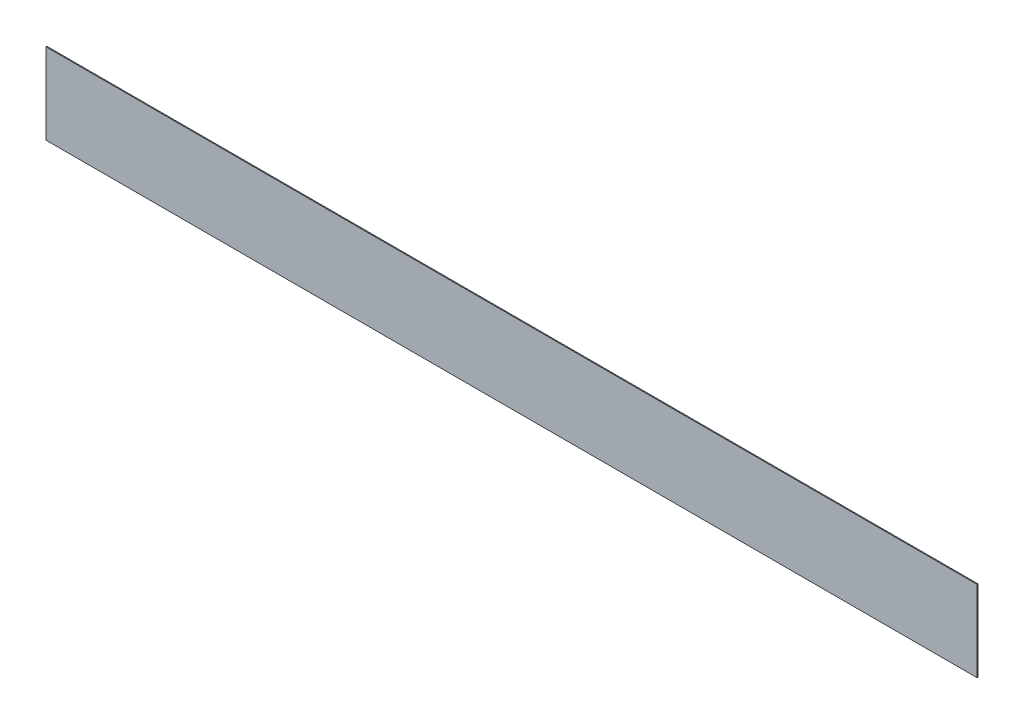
ISO-10303-21;
HEADER;
FILE_DESCRIPTION(('STEP AP214'),'2;1');
FILE_NAME('part.step','',(''),(''),'','','');
FILE_SCHEMA(('AUTOMOTIVE_DESIGN { 1 0 10303 214 1 1 1 1 }'));
ENDSEC;
DATA;
#1=APPLICATION_CONTEXT('core data for automotive mechanical design processes');
#2=APPLICATION_PROTOCOL_DEFINITION('international standard','automotive_design',2000,#1);
#3=PRODUCT_CONTEXT('',#1,'mechanical');
#4=PRODUCT('Part','Part','',(#3));
#5=PRODUCT_RELATED_PRODUCT_CATEGORY('part','',(#4));
#6=PRODUCT_DEFINITION_FORMATION('','',#4);
#7=PRODUCT_DEFINITION_CONTEXT('part definition',#1,'design');
#8=PRODUCT_DEFINITION('design','',#6,#7);
#9=PRODUCT_DEFINITION_SHAPE('','',#8);
#10=(LENGTH_UNIT() NAMED_UNIT(*) SI_UNIT(.MILLI.,.METRE.));
#11=(NAMED_UNIT(*) PLANE_ANGLE_UNIT() SI_UNIT($,.RADIAN.));
#12=(NAMED_UNIT(*) SI_UNIT($,.STERADIAN.) SOLID_ANGLE_UNIT());
#13=UNCERTAINTY_MEASURE_WITH_UNIT(LENGTH_MEASURE(1.E-05),#10,'distance_accuracy_value','');
#14=(GEOMETRIC_REPRESENTATION_CONTEXT(3) GLOBAL_UNCERTAINTY_ASSIGNED_CONTEXT((#13)) GLOBAL_UNIT_ASSIGNED_CONTEXT((#10,
#11,#12)) REPRESENTATION_CONTEXT('',''));
#15=CARTESIAN_POINT('',(0.,0.,0.));
#16=DIRECTION('',(0.,0.,1.));
#17=DIRECTION('',(1.,0.,0.));
#18=AXIS2_PLACEMENT_3D('',#15,#16,#17);
#19=CARTESIAN_POINT('',(0.,0.,2.032));
#20=DIRECTION('',(1.,0.,0.));
#21=DIRECTION('',(0.,0.,-1.));
#22=AXIS2_PLACEMENT_3D('',#19,#20,#21);
#23=PLANE('',#22);
#24=DIRECTION('',(0.,-1.,0.));
#25=VECTOR('',#24,1.);
#26=CARTESIAN_POINT('',(0.,0.,0.));
#27=LINE('',#26,#25);
#28=CARTESIAN_POINT('',(0.,177.8,0.));
#29=VERTEX_POINT('',#28);
#30=CARTESIAN_POINT('',(0.,0.,0.));
#31=VERTEX_POINT('',#30);
#32=EDGE_CURVE('E96',#29,#31,#27,.T.);
#33=ORIENTED_EDGE('',*,*,#32,.T.);
#34=DIRECTION('',(0.,0.,-1.));
#35=VECTOR('',#34,1.);
#36=CARTESIAN_POINT('',(0.,0.,2.032));
#37=LINE('',#36,#35);
#38=CARTESIAN_POINT('',(0.,0.,2.032));
#39=VERTEX_POINT('',#38);
#40=EDGE_CURVE('E11',#39,#31,#37,.T.);
#41=ORIENTED_EDGE('',*,*,#40,.F.);
#42=DIRECTION('',(0.,-1.,0.));
#43=VECTOR('',#42,1.);
#44=CARTESIAN_POINT('',(0.,0.,2.032));
#45=LINE('',#44,#43);
#46=CARTESIAN_POINT('',(0.,177.8,2.032));
#47=VERTEX_POINT('',#46);
#48=EDGE_CURVE('E84',#47,#39,#45,.T.);
#49=ORIENTED_EDGE('',*,*,#48,.F.);
#50=DIRECTION('',(0.,0.,-1.));
#51=VECTOR('',#50,1.);
#52=CARTESIAN_POINT('',(0.,177.8,2.032));
#53=LINE('',#52,#51);
#54=EDGE_CURVE('E92',#47,#29,#53,.T.);
#55=ORIENTED_EDGE('',*,*,#54,.T.);
#56=EDGE_LOOP('',(#33,#41,#49,#55));
#57=FACE_BOUND('',#56,.T.);
#58=ADVANCED_FACE('F33',(#57),#23,.F.);
#59=CARTESIAN_POINT('',(0.,0.,2.032));
#60=DIRECTION('',(0.,1.,0.));
#61=DIRECTION('',(0.,0.,1.));
#62=AXIS2_PLACEMENT_3D('',#59,#60,#61);
#63=PLANE('',#62);
#64=DIRECTION('',(1.,0.,0.));
#65=VECTOR('',#64,1.);
#66=CARTESIAN_POINT('',(0.,0.,0.));
#67=LINE('',#66,#65);
#68=CARTESIAN_POINT('',(2047.24,0.,0.));
#69=VERTEX_POINT('',#68);
#70=EDGE_CURVE('E88',#31,#69,#67,.T.);
#71=ORIENTED_EDGE('',*,*,#70,.T.);
#72=DIRECTION('',(0.,0.,-1.));
#73=VECTOR('',#72,1.);
#74=CARTESIAN_POINT('',(2047.24,0.,2.032));
#75=LINE('',#74,#73);
#76=CARTESIAN_POINT('',(2047.24,0.,2.032));
#77=VERTEX_POINT('',#76);
#78=EDGE_CURVE('E41',#77,#69,#75,.T.);
#79=ORIENTED_EDGE('',*,*,#78,.F.);
#80=DIRECTION('',(1.,0.,0.));
#81=VECTOR('',#80,1.);
#82=CARTESIAN_POINT('',(0.,0.,2.032));
#83=LINE('',#82,#81);
#84=EDGE_CURVE('E79',#39,#77,#83,.T.);
#85=ORIENTED_EDGE('',*,*,#84,.F.);
#86=ORIENTED_EDGE('',*,*,#40,.T.);
#87=EDGE_LOOP('',(#71,#79,#85,#86));
#88=FACE_BOUND('',#87,.T.);
#89=ADVANCED_FACE('F87',(#88),#63,.F.);
#90=CARTESIAN_POINT('',(2047.24,0.,2.032));
#91=DIRECTION('',(-1.,0.,0.));
#92=DIRECTION('',(0.,0.,1.));
#93=AXIS2_PLACEMENT_3D('',#90,#91,#92);
#94=PLANE('',#93);
#95=DIRECTION('',(0.,1.,0.));
#96=VECTOR('',#95,1.);
#97=CARTESIAN_POINT('',(2047.24,0.,0.));
#98=LINE('',#97,#96);
#99=CARTESIAN_POINT('',(2047.24,177.8,0.));
#100=VERTEX_POINT('',#99);
#101=EDGE_CURVE('E66',#69,#100,#98,.T.);
#102=ORIENTED_EDGE('',*,*,#101,.T.);
#103=DIRECTION('',(0.,0.,-1.));
#104=VECTOR('',#103,1.);
#105=CARTESIAN_POINT('',(2047.24,177.8,2.032));
#106=LINE('',#105,#104);
#107=CARTESIAN_POINT('',(2047.24,177.8,2.032));
#108=VERTEX_POINT('',#107);
#109=EDGE_CURVE('E89',#108,#100,#106,.T.);
#110=ORIENTED_EDGE('',*,*,#109,.F.);
#111=DIRECTION('',(0.,1.,0.));
#112=VECTOR('',#111,1.);
#113=CARTESIAN_POINT('',(2047.24,0.,2.032));
#114=LINE('',#113,#112);
#115=EDGE_CURVE('E82',#77,#108,#114,.T.);
#116=ORIENTED_EDGE('',*,*,#115,.F.);
#117=ORIENTED_EDGE('',*,*,#78,.T.);
#118=EDGE_LOOP('',(#102,#110,#116,#117));
#119=FACE_BOUND('',#118,.T.);
#120=ADVANCED_FACE('F90',(#119),#94,.F.);
#121=CARTESIAN_POINT('',(0.,177.8,2.032));
#122=DIRECTION('',(0.,-1.,0.));
#123=DIRECTION('',(1.,0.,0.));
#124=AXIS2_PLACEMENT_3D('',#121,#122,#123);
#125=PLANE('',#124);
#126=DIRECTION('',(-1.,0.,0.));
#127=VECTOR('',#126,1.);
#128=CARTESIAN_POINT('',(0.,177.8,0.));
#129=LINE('',#128,#127);
#130=EDGE_CURVE('E72',#100,#29,#129,.T.);
#131=ORIENTED_EDGE('',*,*,#130,.T.);
#132=ORIENTED_EDGE('',*,*,#54,.F.);
#133=DIRECTION('',(-1.,0.,0.));
#134=VECTOR('',#133,1.);
#135=CARTESIAN_POINT('',(0.,177.8,2.032));
#136=LINE('',#135,#134);
#137=EDGE_CURVE('E49',#108,#47,#136,.T.);
#138=ORIENTED_EDGE('',*,*,#137,.F.);
#139=ORIENTED_EDGE('',*,*,#109,.T.);
#140=EDGE_LOOP('',(#131,#132,#138,#139));
#141=FACE_BOUND('',#140,.T.);
#142=ADVANCED_FACE('F103',(#141),#125,.F.);
#143=CARTESIAN_POINT('',(0.,0.,2.032));
#144=DIRECTION('',(0.,0.,-1.));
#145=DIRECTION('',(-1.,0.,0.));
#146=AXIS2_PLACEMENT_3D('',#143,#144,#145);
#147=PLANE('',#146);
#148=ORIENTED_EDGE('',*,*,#48,.T.);
#149=ORIENTED_EDGE('',*,*,#84,.T.);
#150=ORIENTED_EDGE('',*,*,#115,.T.);
#151=ORIENTED_EDGE('',*,*,#137,.T.);
#152=EDGE_LOOP('',(#148,#149,#150,#151));
#153=FACE_BOUND('',#152,.T.);
#154=ADVANCED_FACE('F80',(#153),#147,.F.);
#155=CARTESIAN_POINT('',(0.,0.,0.));
#156=DIRECTION('',(0.,0.,-1.));
#157=DIRECTION('',(-1.,0.,0.));
#158=AXIS2_PLACEMENT_3D('',#155,#156,#157);
#159=PLANE('',#158);
#160=ORIENTED_EDGE('',*,*,#32,.F.);
#161=ORIENTED_EDGE('',*,*,#130,.F.);
#162=ORIENTED_EDGE('',*,*,#101,.F.);
#163=ORIENTED_EDGE('',*,*,#70,.F.);
#164=EDGE_LOOP('',(#160,#161,#162,#163));
#165=FACE_BOUND('',#164,.T.);
#166=ADVANCED_FACE('F106',(#165),#159,.T.);
#167=CLOSED_SHELL('',(#58,#89,#120,#142,#154,#166));
#168=MANIFOLD_SOLID_BREP('B2',#167);
#169=ADVANCED_BREP_SHAPE_REPRESENTATION('',(#18,#168),#14);
#170=SHAPE_DEFINITION_REPRESENTATION(#9,#169);
ENDSEC;
END-ISO-10303-21;
